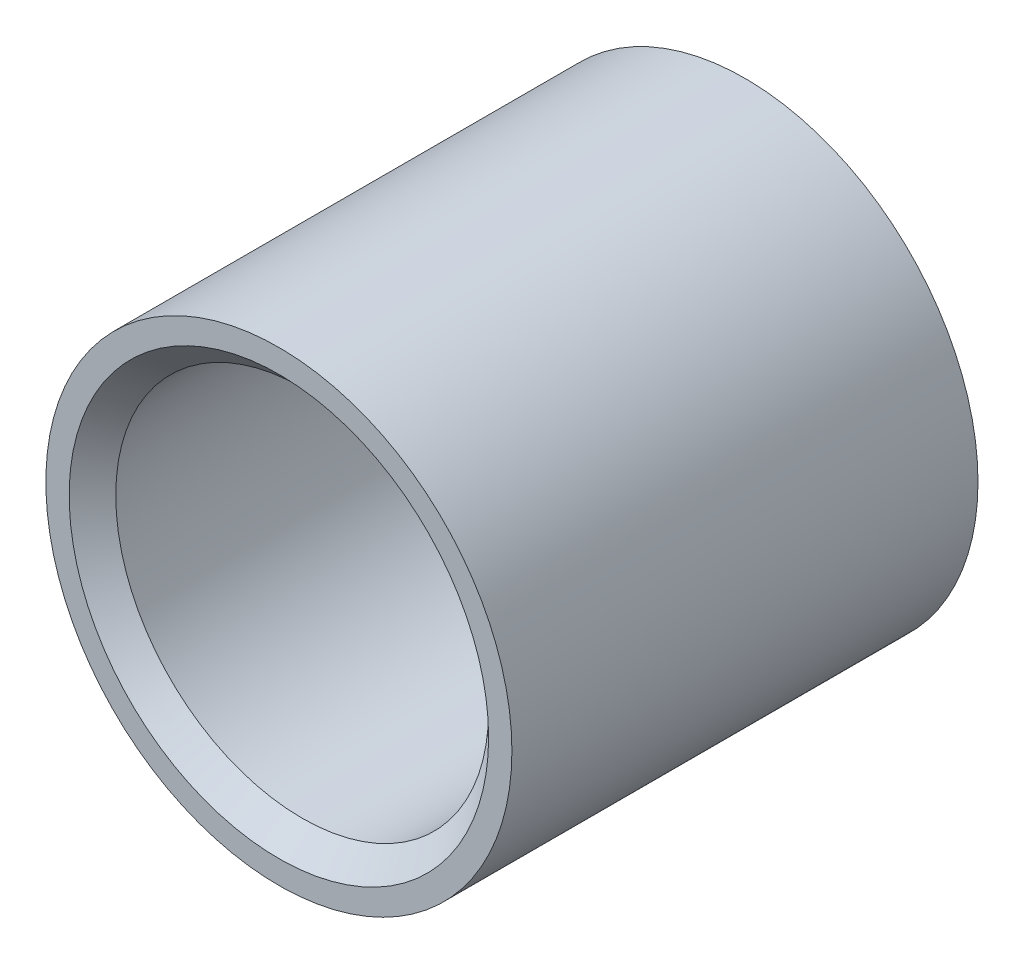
ISO-10303-21;
HEADER;
FILE_DESCRIPTION(('STEP AP214'),'2;1');
FILE_NAME('part.step','',(''),(''),'','','');
FILE_SCHEMA(('AUTOMOTIVE_DESIGN { 1 0 10303 214 1 1 1 1 }'));
ENDSEC;
DATA;
#1=APPLICATION_CONTEXT('core data for automotive mechanical design processes');
#2=APPLICATION_PROTOCOL_DEFINITION('international standard','automotive_design',2000,#1);
#3=PRODUCT_CONTEXT('',#1,'mechanical');
#4=PRODUCT('Part','Part','',(#3));
#5=PRODUCT_RELATED_PRODUCT_CATEGORY('part','',(#4));
#6=PRODUCT_DEFINITION_FORMATION('','',#4);
#7=PRODUCT_DEFINITION_CONTEXT('part definition',#1,'design');
#8=PRODUCT_DEFINITION('design','',#6,#7);
#9=PRODUCT_DEFINITION_SHAPE('','',#8);
#10=(LENGTH_UNIT() NAMED_UNIT(*) SI_UNIT(.MILLI.,.METRE.));
#11=(NAMED_UNIT(*) PLANE_ANGLE_UNIT() SI_UNIT($,.RADIAN.));
#12=(NAMED_UNIT(*) SI_UNIT($,.STERADIAN.) SOLID_ANGLE_UNIT());
#13=UNCERTAINTY_MEASURE_WITH_UNIT(LENGTH_MEASURE(1.E-05),#10,'distance_accuracy_value','');
#14=(GEOMETRIC_REPRESENTATION_CONTEXT(3) GLOBAL_UNCERTAINTY_ASSIGNED_CONTEXT((#13)) GLOBAL_UNIT_ASSIGNED_CONTEXT((#10,
#11,#12)) REPRESENTATION_CONTEXT('',''));
#15=CARTESIAN_POINT('',(0.,0.,0.));
#16=DIRECTION('',(0.,0.,1.));
#17=DIRECTION('',(1.,0.,0.));
#18=AXIS2_PLACEMENT_3D('',#15,#16,#17);
#19=CARTESIAN_POINT('',(0.,0.,5.));
#20=DIRECTION('',(0.,0.,1.));
#21=DIRECTION('',(1.,0.,0.));
#22=AXIS2_PLACEMENT_3D('',#19,#20,#21);
#23=PLANE('',#22);
#24=CARTESIAN_POINT('',(0.,0.,5.));
#25=DIRECTION('',(0.,0.,1.));
#26=DIRECTION('',(1.,0.,0.));
#27=AXIS2_PLACEMENT_3D('',#24,#25,#26);
#28=CIRCLE('',#27,2.25);
#29=CARTESIAN_POINT('',(2.25,0.,5.));
#30=VERTEX_POINT('',#29);
#31=EDGE_CURVE('E10',#30,#30,#28,.F.);
#32=ORIENTED_EDGE('',*,*,#31,.T.);
#33=EDGE_LOOP('',(#32));
#34=FACE_BOUND('',#33,.T.);
#35=CARTESIAN_POINT('',(0.,0.,5.));
#36=DIRECTION('',(0.,0.,1.));
#37=DIRECTION('',(1.,0.,0.));
#38=AXIS2_PLACEMENT_3D('',#35,#36,#37);
#39=CIRCLE('',#38,2.5);
#40=CARTESIAN_POINT('',(2.5,0.,5.));
#41=VERTEX_POINT('',#40);
#42=EDGE_CURVE('E51',#41,#41,#39,.T.);
#43=ORIENTED_EDGE('',*,*,#42,.T.);
#44=EDGE_LOOP('',(#43));
#45=FACE_BOUND('',#44,.T.);
#46=ADVANCED_FACE('F31',(#34,#45),#23,.T.);
#47=CARTESIAN_POINT('',(0.,0.,0.));
#48=DIRECTION('',(0.,0.,1.));
#49=DIRECTION('',(1.,0.,0.));
#50=AXIS2_PLACEMENT_3D('',#47,#48,#49);
#51=PLANE('',#50);
#52=CARTESIAN_POINT('',(0.,0.,0.));
#53=DIRECTION('',(0.,0.,1.));
#54=DIRECTION('',(1.,0.,0.));
#55=AXIS2_PLACEMENT_3D('',#52,#53,#54);
#56=CIRCLE('',#55,2.25);
#57=CARTESIAN_POINT('',(2.25,0.,0.));
#58=VERTEX_POINT('',#57);
#59=EDGE_CURVE('E46',#58,#58,#56,.T.);
#60=ORIENTED_EDGE('',*,*,#59,.T.);
#61=EDGE_LOOP('',(#60));
#62=FACE_BOUND('',#61,.T.);
#63=CARTESIAN_POINT('',(0.,0.,0.));
#64=DIRECTION('',(0.,0.,1.));
#65=DIRECTION('',(1.,0.,0.));
#66=AXIS2_PLACEMENT_3D('',#63,#64,#65);
#67=CIRCLE('',#66,2.5);
#68=CARTESIAN_POINT('',(2.5,0.,0.));
#69=VERTEX_POINT('',#68);
#70=EDGE_CURVE('E52',#69,#69,#67,.T.);
#71=ORIENTED_EDGE('',*,*,#70,.F.);
#72=EDGE_LOOP('',(#71));
#73=FACE_BOUND('',#72,.T.);
#74=ADVANCED_FACE('F63',(#62,#73),#51,.F.);
#75=CARTESIAN_POINT('',(0.,0.,5.));
#76=DIRECTION('',(0.,0.,-1.));
#77=DIRECTION('',(-1.,0.,0.));
#78=AXIS2_PLACEMENT_3D('',#75,#76,#77);
#79=CYLINDRICAL_SURFACE('',#78,2.5);
#80=ORIENTED_EDGE('',*,*,#42,.F.);
#81=EDGE_LOOP('',(#80));
#82=FACE_BOUND('',#81,.T.);
#83=ORIENTED_EDGE('',*,*,#70,.T.);
#84=EDGE_LOOP('',(#83));
#85=FACE_BOUND('',#84,.T.);
#86=ADVANCED_FACE('F59',(#82,#85),#79,.T.);
#87=CARTESIAN_POINT('',(0.,0.,5.));
#88=DIRECTION('',(0.,0.,-1.));
#89=DIRECTION('',(-1.,0.,0.));
#90=AXIS2_PLACEMENT_3D('',#87,#88,#89);
#91=CYLINDRICAL_SURFACE('',#90,2.);
#92=CARTESIAN_POINT('',(0.,0.,0.250000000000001));
#93=DIRECTION('',(0.,0.,1.));
#94=DIRECTION('',(1.,0.,0.));
#95=AXIS2_PLACEMENT_3D('',#92,#93,#94);
#96=CIRCLE('',#95,2.);
#97=CARTESIAN_POINT('',(2.,0.,0.250000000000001));
#98=VERTEX_POINT('',#97);
#99=EDGE_CURVE('E38',#98,#98,#96,.F.);
#100=ORIENTED_EDGE('',*,*,#99,.T.);
#101=EDGE_LOOP('',(#100));
#102=FACE_BOUND('',#101,.T.);
#103=CARTESIAN_POINT('',(0.,0.,4.75));
#104=DIRECTION('',(0.,0.,1.));
#105=DIRECTION('',(1.,0.,0.));
#106=AXIS2_PLACEMENT_3D('',#103,#104,#105);
#107=CIRCLE('',#106,2.);
#108=CARTESIAN_POINT('',(2.,0.,4.75));
#109=VERTEX_POINT('',#108);
#110=EDGE_CURVE('E42',#109,#109,#107,.T.);
#111=ORIENTED_EDGE('',*,*,#110,.T.);
#112=EDGE_LOOP('',(#111));
#113=FACE_BOUND('',#112,.T.);
#114=ADVANCED_FACE('F62',(#102,#113),#91,.F.);
#115=CARTESIAN_POINT('',(0.,0.,0.));
#116=DIRECTION('',(0.,0.,-1.));
#117=DIRECTION('',(-1.,0.,0.));
#118=AXIS2_PLACEMENT_3D('',#115,#116,#117);
#119=CONICAL_SURFACE('',#118,2.25,0.785398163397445);
#120=ORIENTED_EDGE('',*,*,#99,.F.);
#121=EDGE_LOOP('',(#120));
#122=FACE_BOUND('',#121,.T.);
#123=ORIENTED_EDGE('',*,*,#59,.F.);
#124=EDGE_LOOP('',(#123));
#125=FACE_BOUND('',#124,.T.);
#126=ADVANCED_FACE('F75',(#122,#125),#119,.F.);
#127=CARTESIAN_POINT('',(0.,0.,4.75));
#128=DIRECTION('',(0.,0.,1.));
#129=DIRECTION('',(1.,0.,0.));
#130=AXIS2_PLACEMENT_3D('',#127,#128,#129);
#131=CONICAL_SURFACE('',#130,2.,0.785398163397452);
#132=ORIENTED_EDGE('',*,*,#31,.F.);
#133=EDGE_LOOP('',(#132));
#134=FACE_BOUND('',#133,.T.);
#135=ORIENTED_EDGE('',*,*,#110,.F.);
#136=EDGE_LOOP('',(#135));
#137=FACE_BOUND('',#136,.T.);
#138=ADVANCED_FACE('F33',(#134,#137),#131,.F.);
#139=CLOSED_SHELL('',(#46,#74,#86,#114,#126,#138));
#140=MANIFOLD_SOLID_BREP('B2',#139);
#141=ADVANCED_BREP_SHAPE_REPRESENTATION('',(#18,#140),#14);
#142=SHAPE_DEFINITION_REPRESENTATION(#9,#141);
ENDSEC;
END-ISO-10303-21;
